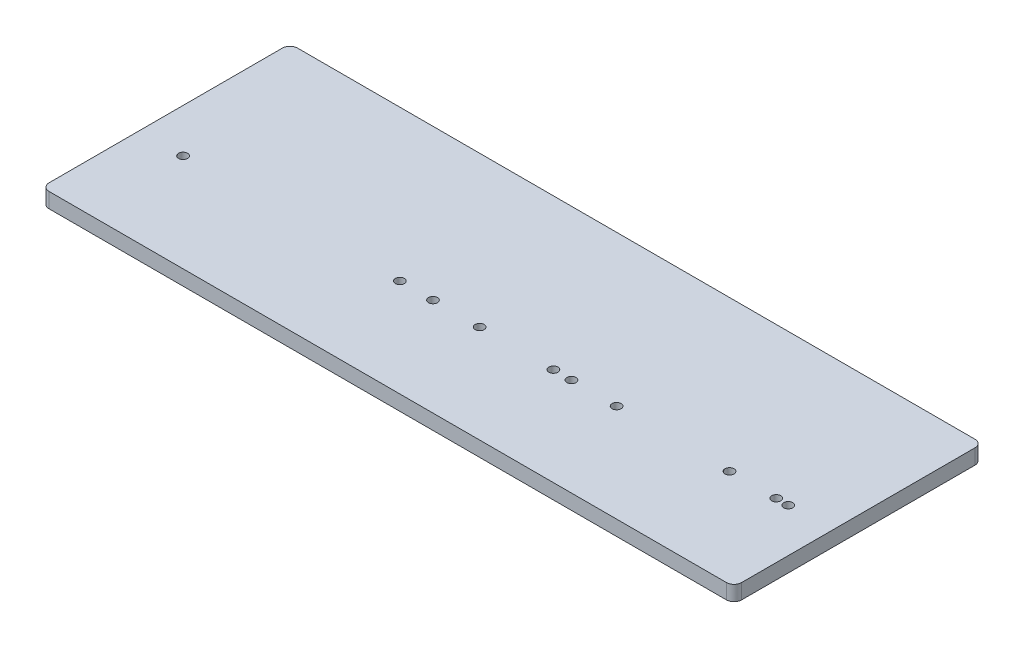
ISO-10303-21;
HEADER;
FILE_DESCRIPTION(('STEP AP214'),'2;1');
FILE_NAME('part.step','',(''),(''),'','','');
FILE_SCHEMA(('AUTOMOTIVE_DESIGN { 1 0 10303 214 1 1 1 1 }'));
ENDSEC;
DATA;
#1=APPLICATION_CONTEXT('core data for automotive mechanical design processes');
#2=APPLICATION_PROTOCOL_DEFINITION('international standard','automotive_design',2000,#1);
#3=PRODUCT_CONTEXT('',#1,'mechanical');
#4=PRODUCT('Part','Part','',(#3));
#5=PRODUCT_RELATED_PRODUCT_CATEGORY('part','',(#4));
#6=PRODUCT_DEFINITION_FORMATION('','',#4);
#7=PRODUCT_DEFINITION_CONTEXT('part definition',#1,'design');
#8=PRODUCT_DEFINITION('design','',#6,#7);
#9=PRODUCT_DEFINITION_SHAPE('','',#8);
#10=(LENGTH_UNIT() NAMED_UNIT(*) SI_UNIT(.MILLI.,.METRE.));
#11=(NAMED_UNIT(*) PLANE_ANGLE_UNIT() SI_UNIT($,.RADIAN.));
#12=(NAMED_UNIT(*) SI_UNIT($,.STERADIAN.) SOLID_ANGLE_UNIT());
#13=UNCERTAINTY_MEASURE_WITH_UNIT(LENGTH_MEASURE(1.E-05),#10,'distance_accuracy_value','');
#14=(GEOMETRIC_REPRESENTATION_CONTEXT(3) GLOBAL_UNCERTAINTY_ASSIGNED_CONTEXT((#13)) GLOBAL_UNIT_ASSIGNED_CONTEXT((#10,
#11,#12)) REPRESENTATION_CONTEXT('',''));
#15=CARTESIAN_POINT('',(0.,0.,0.));
#16=DIRECTION('',(0.,0.,1.));
#17=DIRECTION('',(1.,0.,0.));
#18=AXIS2_PLACEMENT_3D('',#15,#16,#17);
#19=CARTESIAN_POINT('',(-58.8284422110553,10.,-121.896582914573));
#20=DIRECTION('',(1.,0.,0.));
#21=DIRECTION('',(0.,0.,-1.));
#22=AXIS2_PLACEMENT_3D('',#19,#20,#21);
#23=PLANE('',#22);
#24=DIRECTION('',(0.,0.,1.));
#25=VECTOR('',#24,1.);
#26=CARTESIAN_POINT('',(-58.8284422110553,0.,-121.896582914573));
#27=LINE('',#26,#25);
#28=CARTESIAN_POINT('',(-58.8284422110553,0.,-116.896582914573));
#29=VERTEX_POINT('',#28);
#30=CARTESIAN_POINT('',(-58.8284422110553,0.,38.1034170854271));
#31=VERTEX_POINT('',#30);
#32=EDGE_CURVE('E155',#29,#31,#27,.T.);
#33=ORIENTED_EDGE('',*,*,#32,.T.);
#34=DIRECTION('',(0.,-1.,0.));
#35=VECTOR('',#34,1.);
#36=CARTESIAN_POINT('',(-58.8284422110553,10.,38.1034170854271));
#37=LINE('',#36,#35);
#38=CARTESIAN_POINT('',(-58.8284422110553,10.,38.1034170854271));
#39=VERTEX_POINT('',#38);
#40=EDGE_CURVE('E11',#31,#39,#37,.F.);
#41=ORIENTED_EDGE('',*,*,#40,.T.);
#42=DIRECTION('',(0.,0.,1.));
#43=VECTOR('',#42,1.);
#44=CARTESIAN_POINT('',(-58.8284422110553,10.,-121.896582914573));
#45=LINE('',#44,#43);
#46=CARTESIAN_POINT('',(-58.8284422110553,10.,-116.896582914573));
#47=VERTEX_POINT('',#46);
#48=EDGE_CURVE('E118',#47,#39,#45,.T.);
#49=ORIENTED_EDGE('',*,*,#48,.F.);
#50=DIRECTION('',(0.,-1.,0.));
#51=VECTOR('',#50,1.);
#52=CARTESIAN_POINT('',(-58.8284422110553,10.,-116.896582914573));
#53=LINE('',#52,#51);
#54=EDGE_CURVE('E34',#47,#29,#53,.T.);
#55=ORIENTED_EDGE('',*,*,#54,.T.);
#56=EDGE_LOOP('',(#33,#41,#49,#55));
#57=FACE_BOUND('',#56,.T.);
#58=ADVANCED_FACE('F27',(#57),#23,.F.);
#59=CARTESIAN_POINT('',(-58.8284422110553,10.,43.1034170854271));
#60=DIRECTION('',(0.,0.,-1.));
#61=DIRECTION('',(-1.,0.,0.));
#62=AXIS2_PLACEMENT_3D('',#59,#60,#61);
#63=PLANE('',#62);
#64=DIRECTION('',(1.,0.,0.));
#65=VECTOR('',#64,1.);
#66=CARTESIAN_POINT('',(-58.8284422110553,0.,43.1034170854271));
#67=LINE('',#66,#65);
#68=CARTESIAN_POINT('',(-53.8284422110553,0.,43.1034170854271));
#69=VERTEX_POINT('',#68);
#70=CARTESIAN_POINT('',(396.171557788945,0.,43.1034170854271));
#71=VERTEX_POINT('',#70);
#72=EDGE_CURVE('E123',#69,#71,#67,.T.);
#73=ORIENTED_EDGE('',*,*,#72,.T.);
#74=DIRECTION('',(0.,-1.,0.));
#75=VECTOR('',#74,1.);
#76=CARTESIAN_POINT('',(396.171557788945,10.,43.1034170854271));
#77=LINE('',#76,#75);
#78=CARTESIAN_POINT('',(396.171557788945,10.,43.1034170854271));
#79=VERTEX_POINT('',#78);
#80=EDGE_CURVE('E41',#71,#79,#77,.F.);
#81=ORIENTED_EDGE('',*,*,#80,.T.);
#82=DIRECTION('',(1.,0.,0.));
#83=VECTOR('',#82,1.);
#84=CARTESIAN_POINT('',(-58.8284422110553,10.,43.1034170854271));
#85=LINE('',#84,#83);
#86=CARTESIAN_POINT('',(-53.8284422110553,10.,43.1034170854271));
#87=VERTEX_POINT('',#86);
#88=EDGE_CURVE('E121',#87,#79,#85,.T.);
#89=ORIENTED_EDGE('',*,*,#88,.F.);
#90=DIRECTION('',(0.,-1.,0.));
#91=VECTOR('',#90,1.);
#92=CARTESIAN_POINT('',(-53.8284422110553,10.,43.1034170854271));
#93=LINE('',#92,#91);
#94=EDGE_CURVE('E147',#87,#69,#93,.T.);
#95=ORIENTED_EDGE('',*,*,#94,.T.);
#96=EDGE_LOOP('',(#73,#81,#89,#95));
#97=FACE_BOUND('',#96,.T.);
#98=ADVANCED_FACE('F253',(#97),#63,.F.);
#99=CARTESIAN_POINT('',(401.171557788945,10.,-121.896582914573));
#100=DIRECTION('',(-1.,0.,0.));
#101=DIRECTION('',(0.,0.,1.));
#102=AXIS2_PLACEMENT_3D('',#99,#100,#101);
#103=PLANE('',#102);
#104=DIRECTION('',(0.,0.,-1.));
#105=VECTOR('',#104,1.);
#106=CARTESIAN_POINT('',(401.171557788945,0.,-121.896582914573));
#107=LINE('',#106,#105);
#108=CARTESIAN_POINT('',(401.171557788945,0.,38.1034170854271));
#109=VERTEX_POINT('',#108);
#110=CARTESIAN_POINT('',(401.171557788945,0.,-116.896582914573));
#111=VERTEX_POINT('',#110);
#112=EDGE_CURVE('E119',#109,#111,#107,.T.);
#113=ORIENTED_EDGE('',*,*,#112,.T.);
#114=DIRECTION('',(0.,-1.,0.));
#115=VECTOR('',#114,1.);
#116=CARTESIAN_POINT('',(401.171557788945,10.,-116.896582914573));
#117=LINE('',#116,#115);
#118=CARTESIAN_POINT('',(401.171557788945,10.,-116.896582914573));
#119=VERTEX_POINT('',#118);
#120=EDGE_CURVE('E97',#111,#119,#117,.F.);
#121=ORIENTED_EDGE('',*,*,#120,.T.);
#122=DIRECTION('',(0.,0.,-1.));
#123=VECTOR('',#122,1.);
#124=CARTESIAN_POINT('',(401.171557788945,10.,-121.896582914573));
#125=LINE('',#124,#123);
#126=CARTESIAN_POINT('',(401.171557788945,10.,38.1034170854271));
#127=VERTEX_POINT('',#126);
#128=EDGE_CURVE('E128',#127,#119,#125,.T.);
#129=ORIENTED_EDGE('',*,*,#128,.F.);
#130=DIRECTION('',(0.,-1.,0.));
#131=VECTOR('',#130,1.);
#132=CARTESIAN_POINT('',(401.171557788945,10.,38.1034170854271));
#133=LINE('',#132,#131);
#134=EDGE_CURVE('E102',#127,#109,#133,.T.);
#135=ORIENTED_EDGE('',*,*,#134,.T.);
#136=EDGE_LOOP('',(#113,#121,#129,#135));
#137=FACE_BOUND('',#136,.T.);
#138=ADVANCED_FACE('F250',(#137),#103,.F.);
#139=CARTESIAN_POINT('',(-58.8284422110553,10.,-121.896582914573));
#140=DIRECTION('',(0.,0.,1.));
#141=DIRECTION('',(1.,0.,0.));
#142=AXIS2_PLACEMENT_3D('',#139,#140,#141);
#143=PLANE('',#142);
#144=DIRECTION('',(-1.,0.,0.));
#145=VECTOR('',#144,1.);
#146=CARTESIAN_POINT('',(-58.8284422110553,10.,-121.896582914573));
#147=LINE('',#146,#145);
#148=CARTESIAN_POINT('',(396.171557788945,10.,-121.896582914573));
#149=VERTEX_POINT('',#148);
#150=CARTESIAN_POINT('',(-53.8284422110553,10.,-121.896582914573));
#151=VERTEX_POINT('',#150);
#152=EDGE_CURVE('E112',#149,#151,#147,.T.);
#153=ORIENTED_EDGE('',*,*,#152,.F.);
#154=DIRECTION('',(0.,-1.,0.));
#155=VECTOR('',#154,1.);
#156=CARTESIAN_POINT('',(396.171557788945,10.,-121.896582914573));
#157=LINE('',#156,#155);
#158=CARTESIAN_POINT('',(396.171557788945,0.,-121.896582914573));
#159=VERTEX_POINT('',#158);
#160=EDGE_CURVE('E96',#149,#159,#157,.T.);
#161=ORIENTED_EDGE('',*,*,#160,.T.);
#162=DIRECTION('',(-1.,0.,0.));
#163=VECTOR('',#162,1.);
#164=CARTESIAN_POINT('',(-58.8284422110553,0.,-121.896582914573));
#165=LINE('',#164,#163);
#166=CARTESIAN_POINT('',(-53.8284422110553,0.,-121.896582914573));
#167=VERTEX_POINT('',#166);
#168=EDGE_CURVE('E109',#159,#167,#165,.T.);
#169=ORIENTED_EDGE('',*,*,#168,.T.);
#170=DIRECTION('',(0.,-1.,0.));
#171=VECTOR('',#170,1.);
#172=CARTESIAN_POINT('',(-53.8284422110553,10.,-121.896582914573));
#173=LINE('',#172,#171);
#174=EDGE_CURVE('E114',#167,#151,#173,.F.);
#175=ORIENTED_EDGE('',*,*,#174,.T.);
#176=EDGE_LOOP('',(#153,#161,#169,#175));
#177=FACE_BOUND('',#176,.T.);
#178=ADVANCED_FACE('F108',(#177),#143,.F.);
#179=CARTESIAN_POINT('',(-58.8284422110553,10.,43.1034170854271));
#180=DIRECTION('',(0.,1.,0.));
#181=DIRECTION('',(0.,0.,1.));
#182=AXIS2_PLACEMENT_3D('',#179,#180,#181);
#183=PLANE('',#182);
#184=CARTESIAN_POINT('',(372.171557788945,10.,-21.8965829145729));
#185=DIRECTION('',(0.,1.,0.));
#186=DIRECTION('',(0.,0.,1.));
#187=AXIS2_PLACEMENT_3D('',#184,#185,#186);
#188=CIRCLE('',#187,2.99999999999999);
#189=CARTESIAN_POINT('',(372.171557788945,10.,-18.8965829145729));
#190=VERTEX_POINT('',#189);
#191=EDGE_CURVE('E219',#190,#190,#188,.T.);
#192=ORIENTED_EDGE('',*,*,#191,.F.);
#193=EDGE_LOOP('',(#192));
#194=FACE_BOUND('',#193,.T.);
#195=CARTESIAN_POINT('',(364.171557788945,10.,-21.8965829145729));
#196=DIRECTION('',(0.,1.,0.));
#197=DIRECTION('',(0.,0.,1.));
#198=AXIS2_PLACEMENT_3D('',#195,#196,#197);
#199=CIRCLE('',#198,2.99999999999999);
#200=CARTESIAN_POINT('',(364.171557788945,10.,-18.8965829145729));
#201=VERTEX_POINT('',#200);
#202=EDGE_CURVE('E213',#201,#201,#199,.T.);
#203=ORIENTED_EDGE('',*,*,#202,.F.);
#204=EDGE_LOOP('',(#203));
#205=FACE_BOUND('',#204,.T.);
#206=CARTESIAN_POINT('',(333.171557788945,10.,-21.8965829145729));
#207=DIRECTION('',(0.,1.,0.));
#208=DIRECTION('',(0.,0.,1.));
#209=AXIS2_PLACEMENT_3D('',#206,#207,#208);
#210=CIRCLE('',#209,2.99999999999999);
#211=CARTESIAN_POINT('',(333.171557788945,10.,-18.8965829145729));
#212=VERTEX_POINT('',#211);
#213=EDGE_CURVE('E207',#212,#212,#210,.T.);
#214=ORIENTED_EDGE('',*,*,#213,.F.);
#215=EDGE_LOOP('',(#214));
#216=FACE_BOUND('',#215,.T.);
#217=CARTESIAN_POINT('',(258.171557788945,10.,-21.8965829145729));
#218=DIRECTION('',(0.,1.,0.));
#219=DIRECTION('',(0.,0.,1.));
#220=AXIS2_PLACEMENT_3D('',#217,#218,#219);
#221=CIRCLE('',#220,2.99999999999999);
#222=CARTESIAN_POINT('',(258.171557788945,10.,-18.8965829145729));
#223=VERTEX_POINT('',#222);
#224=EDGE_CURVE('E201',#223,#223,#221,.T.);
#225=ORIENTED_EDGE('',*,*,#224,.F.);
#226=EDGE_LOOP('',(#225));
#227=FACE_BOUND('',#226,.T.);
#228=CARTESIAN_POINT('',(228.171557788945,10.,-21.8965829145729));
#229=DIRECTION('',(0.,1.,0.));
#230=DIRECTION('',(0.,0.,1.));
#231=AXIS2_PLACEMENT_3D('',#228,#229,#230);
#232=CIRCLE('',#231,2.99999999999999);
#233=CARTESIAN_POINT('',(228.171557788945,10.,-18.8965829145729));
#234=VERTEX_POINT('',#233);
#235=EDGE_CURVE('E195',#234,#234,#232,.T.);
#236=ORIENTED_EDGE('',*,*,#235,.F.);
#237=EDGE_LOOP('',(#236));
#238=FACE_BOUND('',#237,.T.);
#239=CARTESIAN_POINT('',(216.171557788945,10.,-21.8965829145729));
#240=DIRECTION('',(0.,1.,0.));
#241=DIRECTION('',(0.,0.,1.));
#242=AXIS2_PLACEMENT_3D('',#239,#240,#241);
#243=CIRCLE('',#242,2.99999999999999);
#244=CARTESIAN_POINT('',(216.171557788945,10.,-18.8965829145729));
#245=VERTEX_POINT('',#244);
#246=EDGE_CURVE('E189',#245,#245,#243,.T.);
#247=ORIENTED_EDGE('',*,*,#246,.F.);
#248=EDGE_LOOP('',(#247));
#249=FACE_BOUND('',#248,.T.);
#250=CARTESIAN_POINT('',(167.171557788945,10.,-21.8965829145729));
#251=DIRECTION('',(0.,1.,0.));
#252=DIRECTION('',(0.,0.,1.));
#253=AXIS2_PLACEMENT_3D('',#250,#251,#252);
#254=CIRCLE('',#253,2.99999999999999);
#255=CARTESIAN_POINT('',(167.171557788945,10.,-18.8965829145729));
#256=VERTEX_POINT('',#255);
#257=EDGE_CURVE('E183',#256,#256,#254,.T.);
#258=ORIENTED_EDGE('',*,*,#257,.F.);
#259=EDGE_LOOP('',(#258));
#260=FACE_BOUND('',#259,.T.);
#261=CARTESIAN_POINT('',(114.171557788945,10.,-21.8965829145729));
#262=DIRECTION('',(0.,1.,0.));
#263=DIRECTION('',(0.,0.,1.));
#264=AXIS2_PLACEMENT_3D('',#261,#262,#263);
#265=CIRCLE('',#264,3.00000000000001);
#266=CARTESIAN_POINT('',(114.171557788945,10.,-18.8965829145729));
#267=VERTEX_POINT('',#266);
#268=EDGE_CURVE('E177',#267,#267,#265,.T.);
#269=ORIENTED_EDGE('',*,*,#268,.F.);
#270=EDGE_LOOP('',(#269));
#271=FACE_BOUND('',#270,.T.);
#272=CARTESIAN_POINT('',(136.171557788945,10.,-21.8965829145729));
#273=DIRECTION('',(0.,1.,0.));
#274=DIRECTION('',(0.,0.,1.));
#275=AXIS2_PLACEMENT_3D('',#272,#273,#274);
#276=CIRCLE('',#275,2.99999999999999);
#277=CARTESIAN_POINT('',(136.171557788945,10.,-18.8965829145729));
#278=VERTEX_POINT('',#277);
#279=EDGE_CURVE('E171',#278,#278,#276,.T.);
#280=ORIENTED_EDGE('',*,*,#279,.F.);
#281=EDGE_LOOP('',(#280));
#282=FACE_BOUND('',#281,.T.);
#283=CARTESIAN_POINT('',(-29.8284422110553,10.,-21.8965829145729));
#284=DIRECTION('',(0.,1.,0.));
#285=DIRECTION('',(0.,0.,1.));
#286=AXIS2_PLACEMENT_3D('',#283,#284,#285);
#287=CIRCLE('',#286,3.);
#288=CARTESIAN_POINT('',(-29.8284422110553,10.,-18.8965829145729));
#289=VERTEX_POINT('',#288);
#290=EDGE_CURVE('E163',#289,#289,#287,.T.);
#291=ORIENTED_EDGE('',*,*,#290,.F.);
#292=EDGE_LOOP('',(#291));
#293=FACE_BOUND('',#292,.T.);
#294=ORIENTED_EDGE('',*,*,#128,.T.);
#295=CARTESIAN_POINT('',(396.171557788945,10.,-116.896582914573));
#296=DIRECTION('',(0.,1.,0.));
#297=DIRECTION('',(0.,0.,1.));
#298=AXIS2_PLACEMENT_3D('',#295,#296,#297);
#299=CIRCLE('',#298,5.);
#300=EDGE_CURVE('E145',#119,#149,#299,.T.);
#301=ORIENTED_EDGE('',*,*,#300,.T.);
#302=ORIENTED_EDGE('',*,*,#152,.T.);
#303=CARTESIAN_POINT('',(-53.8284422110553,10.,-116.896582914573));
#304=DIRECTION('',(0.,1.,0.));
#305=DIRECTION('',(0.,0.,1.));
#306=AXIS2_PLACEMENT_3D('',#303,#304,#305);
#307=CIRCLE('',#306,5.);
#308=EDGE_CURVE('E140',#151,#47,#307,.T.);
#309=ORIENTED_EDGE('',*,*,#308,.T.);
#310=ORIENTED_EDGE('',*,*,#48,.T.);
#311=CARTESIAN_POINT('',(-53.8284422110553,10.,38.1034170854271));
#312=DIRECTION('',(0.,1.,0.));
#313=DIRECTION('',(0.,0.,1.));
#314=AXIS2_PLACEMENT_3D('',#311,#312,#313);
#315=CIRCLE('',#314,5.);
#316=EDGE_CURVE('E48',#39,#87,#315,.T.);
#317=ORIENTED_EDGE('',*,*,#316,.T.);
#318=ORIENTED_EDGE('',*,*,#88,.T.);
#319=CARTESIAN_POINT('',(396.171557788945,10.,38.1034170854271));
#320=DIRECTION('',(0.,1.,0.));
#321=DIRECTION('',(0.,0.,1.));
#322=AXIS2_PLACEMENT_3D('',#319,#320,#321);
#323=CIRCLE('',#322,5.);
#324=EDGE_CURVE('E143',#79,#127,#323,.T.);
#325=ORIENTED_EDGE('',*,*,#324,.T.);
#326=EDGE_LOOP('',(#294,#301,#302,#309,#310,#317,#318,#325));
#327=FACE_BOUND('',#326,.T.);
#328=ADVANCED_FACE('F225',(#194,#205,#216,#227,#238,#249,#260,#271,#282,#293,#327),#183,.T.);
#329=CARTESIAN_POINT('',(-58.8284422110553,0.,43.1034170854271));
#330=DIRECTION('',(0.,1.,0.));
#331=DIRECTION('',(0.,0.,1.));
#332=AXIS2_PLACEMENT_3D('',#329,#330,#331);
#333=PLANE('',#332);
#334=CARTESIAN_POINT('',(372.171557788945,0.,-21.8965829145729));
#335=DIRECTION('',(0.,1.,0.));
#336=DIRECTION('',(0.,0.,1.));
#337=AXIS2_PLACEMENT_3D('',#334,#335,#336);
#338=CIRCLE('',#337,2.99999999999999);
#339=CARTESIAN_POINT('',(372.171557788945,0.,-18.8965829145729));
#340=VERTEX_POINT('',#339);
#341=EDGE_CURVE('E216',#340,#340,#338,.T.);
#342=ORIENTED_EDGE('',*,*,#341,.T.);
#343=EDGE_LOOP('',(#342));
#344=FACE_BOUND('',#343,.T.);
#345=CARTESIAN_POINT('',(364.171557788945,0.,-21.8965829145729));
#346=DIRECTION('',(0.,1.,0.));
#347=DIRECTION('',(0.,0.,1.));
#348=AXIS2_PLACEMENT_3D('',#345,#346,#347);
#349=CIRCLE('',#348,2.99999999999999);
#350=CARTESIAN_POINT('',(364.171557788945,0.,-18.8965829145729));
#351=VERTEX_POINT('',#350);
#352=EDGE_CURVE('E210',#351,#351,#349,.T.);
#353=ORIENTED_EDGE('',*,*,#352,.T.);
#354=EDGE_LOOP('',(#353));
#355=FACE_BOUND('',#354,.T.);
#356=CARTESIAN_POINT('',(333.171557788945,0.,-21.8965829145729));
#357=DIRECTION('',(0.,1.,0.));
#358=DIRECTION('',(0.,0.,1.));
#359=AXIS2_PLACEMENT_3D('',#356,#357,#358);
#360=CIRCLE('',#359,2.99999999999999);
#361=CARTESIAN_POINT('',(333.171557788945,0.,-18.8965829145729));
#362=VERTEX_POINT('',#361);
#363=EDGE_CURVE('E204',#362,#362,#360,.T.);
#364=ORIENTED_EDGE('',*,*,#363,.T.);
#365=EDGE_LOOP('',(#364));
#366=FACE_BOUND('',#365,.T.);
#367=CARTESIAN_POINT('',(258.171557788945,0.,-21.8965829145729));
#368=DIRECTION('',(0.,1.,0.));
#369=DIRECTION('',(0.,0.,1.));
#370=AXIS2_PLACEMENT_3D('',#367,#368,#369);
#371=CIRCLE('',#370,2.99999999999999);
#372=CARTESIAN_POINT('',(258.171557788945,0.,-18.8965829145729));
#373=VERTEX_POINT('',#372);
#374=EDGE_CURVE('E198',#373,#373,#371,.T.);
#375=ORIENTED_EDGE('',*,*,#374,.T.);
#376=EDGE_LOOP('',(#375));
#377=FACE_BOUND('',#376,.T.);
#378=CARTESIAN_POINT('',(228.171557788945,0.,-21.8965829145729));
#379=DIRECTION('',(0.,1.,0.));
#380=DIRECTION('',(0.,0.,1.));
#381=AXIS2_PLACEMENT_3D('',#378,#379,#380);
#382=CIRCLE('',#381,2.99999999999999);
#383=CARTESIAN_POINT('',(228.171557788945,0.,-18.8965829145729));
#384=VERTEX_POINT('',#383);
#385=EDGE_CURVE('E192',#384,#384,#382,.T.);
#386=ORIENTED_EDGE('',*,*,#385,.T.);
#387=EDGE_LOOP('',(#386));
#388=FACE_BOUND('',#387,.T.);
#389=CARTESIAN_POINT('',(216.171557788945,0.,-21.8965829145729));
#390=DIRECTION('',(0.,1.,0.));
#391=DIRECTION('',(0.,0.,1.));
#392=AXIS2_PLACEMENT_3D('',#389,#390,#391);
#393=CIRCLE('',#392,2.99999999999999);
#394=CARTESIAN_POINT('',(216.171557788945,0.,-18.8965829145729));
#395=VERTEX_POINT('',#394);
#396=EDGE_CURVE('E186',#395,#395,#393,.T.);
#397=ORIENTED_EDGE('',*,*,#396,.T.);
#398=EDGE_LOOP('',(#397));
#399=FACE_BOUND('',#398,.T.);
#400=CARTESIAN_POINT('',(167.171557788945,0.,-21.8965829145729));
#401=DIRECTION('',(0.,1.,0.));
#402=DIRECTION('',(0.,0.,1.));
#403=AXIS2_PLACEMENT_3D('',#400,#401,#402);
#404=CIRCLE('',#403,2.99999999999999);
#405=CARTESIAN_POINT('',(167.171557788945,0.,-18.8965829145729));
#406=VERTEX_POINT('',#405);
#407=EDGE_CURVE('E180',#406,#406,#404,.T.);
#408=ORIENTED_EDGE('',*,*,#407,.T.);
#409=EDGE_LOOP('',(#408));
#410=FACE_BOUND('',#409,.T.);
#411=CARTESIAN_POINT('',(114.171557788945,0.,-21.8965829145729));
#412=DIRECTION('',(0.,1.,0.));
#413=DIRECTION('',(0.,0.,1.));
#414=AXIS2_PLACEMENT_3D('',#411,#412,#413);
#415=CIRCLE('',#414,3.00000000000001);
#416=CARTESIAN_POINT('',(114.171557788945,0.,-18.8965829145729));
#417=VERTEX_POINT('',#416);
#418=EDGE_CURVE('E174',#417,#417,#415,.T.);
#419=ORIENTED_EDGE('',*,*,#418,.T.);
#420=EDGE_LOOP('',(#419));
#421=FACE_BOUND('',#420,.T.);
#422=CARTESIAN_POINT('',(136.171557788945,0.,-21.8965829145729));
#423=DIRECTION('',(0.,1.,0.));
#424=DIRECTION('',(0.,0.,1.));
#425=AXIS2_PLACEMENT_3D('',#422,#423,#424);
#426=CIRCLE('',#425,2.99999999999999);
#427=CARTESIAN_POINT('',(136.171557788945,0.,-18.8965829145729));
#428=VERTEX_POINT('',#427);
#429=EDGE_CURVE('E168',#428,#428,#426,.T.);
#430=ORIENTED_EDGE('',*,*,#429,.T.);
#431=EDGE_LOOP('',(#430));
#432=FACE_BOUND('',#431,.T.);
#433=CARTESIAN_POINT('',(-29.8284422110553,0.,-21.8965829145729));
#434=DIRECTION('',(0.,1.,0.));
#435=DIRECTION('',(0.,0.,1.));
#436=AXIS2_PLACEMENT_3D('',#433,#434,#435);
#437=CIRCLE('',#436,3.);
#438=CARTESIAN_POINT('',(-29.8284422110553,0.,-18.8965829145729));
#439=VERTEX_POINT('',#438);
#440=EDGE_CURVE('E160',#439,#439,#437,.T.);
#441=ORIENTED_EDGE('',*,*,#440,.T.);
#442=EDGE_LOOP('',(#441));
#443=FACE_BOUND('',#442,.T.);
#444=ORIENTED_EDGE('',*,*,#168,.F.);
#445=CARTESIAN_POINT('',(396.171557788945,0.,-116.896582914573));
#446=DIRECTION('',(0.,1.,0.));
#447=DIRECTION('',(0.,0.,1.));
#448=AXIS2_PLACEMENT_3D('',#445,#446,#447);
#449=CIRCLE('',#448,5.);
#450=EDGE_CURVE('E92',#159,#111,#449,.F.);
#451=ORIENTED_EDGE('',*,*,#450,.T.);
#452=ORIENTED_EDGE('',*,*,#112,.F.);
#453=CARTESIAN_POINT('',(396.171557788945,0.,38.1034170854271));
#454=DIRECTION('',(0.,1.,0.));
#455=DIRECTION('',(0.,0.,1.));
#456=AXIS2_PLACEMENT_3D('',#453,#454,#455);
#457=CIRCLE('',#456,5.);
#458=EDGE_CURVE('E103',#109,#71,#457,.F.);
#459=ORIENTED_EDGE('',*,*,#458,.T.);
#460=ORIENTED_EDGE('',*,*,#72,.F.);
#461=CARTESIAN_POINT('',(-53.8284422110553,0.,38.1034170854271));
#462=DIRECTION('',(0.,1.,0.));
#463=DIRECTION('',(0.,0.,1.));
#464=AXIS2_PLACEMENT_3D('',#461,#462,#463);
#465=CIRCLE('',#464,5.);
#466=EDGE_CURVE('E134',#69,#31,#465,.F.);
#467=ORIENTED_EDGE('',*,*,#466,.T.);
#468=ORIENTED_EDGE('',*,*,#32,.F.);
#469=CARTESIAN_POINT('',(-53.8284422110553,0.,-116.896582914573));
#470=DIRECTION('',(0.,1.,0.));
#471=DIRECTION('',(0.,0.,1.));
#472=AXIS2_PLACEMENT_3D('',#469,#470,#471);
#473=CIRCLE('',#472,5.);
#474=EDGE_CURVE('E113',#29,#167,#473,.F.);
#475=ORIENTED_EDGE('',*,*,#474,.T.);
#476=EDGE_LOOP('',(#444,#451,#452,#459,#460,#467,#468,#475));
#477=FACE_BOUND('',#476,.T.);
#478=ADVANCED_FACE('F116',(#344,#355,#366,#377,#388,#399,#410,#421,#432,#443,#477),#333,.F.);
#479=CARTESIAN_POINT('',(-29.8284422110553,0.,-21.8965829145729));
#480=DIRECTION('',(0.,1.,0.));
#481=DIRECTION('',(0.,0.,1.));
#482=AXIS2_PLACEMENT_3D('',#479,#480,#481);
#483=CYLINDRICAL_SURFACE('',#482,3.);
#484=ORIENTED_EDGE('',*,*,#440,.F.);
#485=EDGE_LOOP('',(#484));
#486=FACE_BOUND('',#485,.T.);
#487=ORIENTED_EDGE('',*,*,#290,.T.);
#488=EDGE_LOOP('',(#487));
#489=FACE_BOUND('',#488,.T.);
#490=ADVANCED_FACE('F278',(#486,#489),#483,.F.);
#491=CARTESIAN_POINT('',(136.171557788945,0.,-21.8965829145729));
#492=DIRECTION('',(0.,1.,0.));
#493=DIRECTION('',(0.,0.,1.));
#494=AXIS2_PLACEMENT_3D('',#491,#492,#493);
#495=CYLINDRICAL_SURFACE('',#494,2.99999999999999);
#496=ORIENTED_EDGE('',*,*,#429,.F.);
#497=EDGE_LOOP('',(#496));
#498=FACE_BOUND('',#497,.T.);
#499=ORIENTED_EDGE('',*,*,#279,.T.);
#500=EDGE_LOOP('',(#499));
#501=FACE_BOUND('',#500,.T.);
#502=ADVANCED_FACE('F282',(#498,#501),#495,.F.);
#503=CARTESIAN_POINT('',(114.171557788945,0.,-21.8965829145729));
#504=DIRECTION('',(0.,1.,0.));
#505=DIRECTION('',(0.,0.,1.));
#506=AXIS2_PLACEMENT_3D('',#503,#504,#505);
#507=CYLINDRICAL_SURFACE('',#506,3.00000000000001);
#508=ORIENTED_EDGE('',*,*,#418,.F.);
#509=EDGE_LOOP('',(#508));
#510=FACE_BOUND('',#509,.T.);
#511=ORIENTED_EDGE('',*,*,#268,.T.);
#512=EDGE_LOOP('',(#511));
#513=FACE_BOUND('',#512,.T.);
#514=ADVANCED_FACE('F286',(#510,#513),#507,.F.);
#515=CARTESIAN_POINT('',(167.171557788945,0.,-21.8965829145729));
#516=DIRECTION('',(0.,1.,0.));
#517=DIRECTION('',(0.,0.,1.));
#518=AXIS2_PLACEMENT_3D('',#515,#516,#517);
#519=CYLINDRICAL_SURFACE('',#518,2.99999999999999);
#520=ORIENTED_EDGE('',*,*,#407,.F.);
#521=EDGE_LOOP('',(#520));
#522=FACE_BOUND('',#521,.T.);
#523=ORIENTED_EDGE('',*,*,#257,.T.);
#524=EDGE_LOOP('',(#523));
#525=FACE_BOUND('',#524,.T.);
#526=ADVANCED_FACE('F290',(#522,#525),#519,.F.);
#527=CARTESIAN_POINT('',(216.171557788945,0.,-21.8965829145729));
#528=DIRECTION('',(0.,1.,0.));
#529=DIRECTION('',(0.,0.,1.));
#530=AXIS2_PLACEMENT_3D('',#527,#528,#529);
#531=CYLINDRICAL_SURFACE('',#530,2.99999999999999);
#532=ORIENTED_EDGE('',*,*,#396,.F.);
#533=EDGE_LOOP('',(#532));
#534=FACE_BOUND('',#533,.T.);
#535=ORIENTED_EDGE('',*,*,#246,.T.);
#536=EDGE_LOOP('',(#535));
#537=FACE_BOUND('',#536,.T.);
#538=ADVANCED_FACE('F294',(#534,#537),#531,.F.);
#539=CARTESIAN_POINT('',(228.171557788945,0.,-21.8965829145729));
#540=DIRECTION('',(0.,1.,0.));
#541=DIRECTION('',(0.,0.,1.));
#542=AXIS2_PLACEMENT_3D('',#539,#540,#541);
#543=CYLINDRICAL_SURFACE('',#542,2.99999999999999);
#544=ORIENTED_EDGE('',*,*,#385,.F.);
#545=EDGE_LOOP('',(#544));
#546=FACE_BOUND('',#545,.T.);
#547=ORIENTED_EDGE('',*,*,#235,.T.);
#548=EDGE_LOOP('',(#547));
#549=FACE_BOUND('',#548,.T.);
#550=ADVANCED_FACE('F298',(#546,#549),#543,.F.);
#551=CARTESIAN_POINT('',(258.171557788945,0.,-21.8965829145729));
#552=DIRECTION('',(0.,1.,0.));
#553=DIRECTION('',(0.,0.,1.));
#554=AXIS2_PLACEMENT_3D('',#551,#552,#553);
#555=CYLINDRICAL_SURFACE('',#554,2.99999999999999);
#556=ORIENTED_EDGE('',*,*,#374,.F.);
#557=EDGE_LOOP('',(#556));
#558=FACE_BOUND('',#557,.T.);
#559=ORIENTED_EDGE('',*,*,#224,.T.);
#560=EDGE_LOOP('',(#559));
#561=FACE_BOUND('',#560,.T.);
#562=ADVANCED_FACE('F302',(#558,#561),#555,.F.);
#563=CARTESIAN_POINT('',(333.171557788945,0.,-21.8965829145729));
#564=DIRECTION('',(0.,1.,0.));
#565=DIRECTION('',(0.,0.,1.));
#566=AXIS2_PLACEMENT_3D('',#563,#564,#565);
#567=CYLINDRICAL_SURFACE('',#566,2.99999999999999);
#568=ORIENTED_EDGE('',*,*,#363,.F.);
#569=EDGE_LOOP('',(#568));
#570=FACE_BOUND('',#569,.T.);
#571=ORIENTED_EDGE('',*,*,#213,.T.);
#572=EDGE_LOOP('',(#571));
#573=FACE_BOUND('',#572,.T.);
#574=ADVANCED_FACE('F306',(#570,#573),#567,.F.);
#575=CARTESIAN_POINT('',(364.171557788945,0.,-21.8965829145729));
#576=DIRECTION('',(0.,1.,0.));
#577=DIRECTION('',(0.,0.,1.));
#578=AXIS2_PLACEMENT_3D('',#575,#576,#577);
#579=CYLINDRICAL_SURFACE('',#578,2.99999999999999);
#580=ORIENTED_EDGE('',*,*,#352,.F.);
#581=EDGE_LOOP('',(#580));
#582=FACE_BOUND('',#581,.T.);
#583=ORIENTED_EDGE('',*,*,#202,.T.);
#584=EDGE_LOOP('',(#583));
#585=FACE_BOUND('',#584,.T.);
#586=ADVANCED_FACE('F310',(#582,#585),#579,.F.);
#587=CARTESIAN_POINT('',(372.171557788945,0.,-21.8965829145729));
#588=DIRECTION('',(0.,1.,0.));
#589=DIRECTION('',(0.,0.,1.));
#590=AXIS2_PLACEMENT_3D('',#587,#588,#589);
#591=CYLINDRICAL_SURFACE('',#590,2.99999999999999);
#592=ORIENTED_EDGE('',*,*,#341,.F.);
#593=EDGE_LOOP('',(#592));
#594=FACE_BOUND('',#593,.T.);
#595=ORIENTED_EDGE('',*,*,#191,.T.);
#596=EDGE_LOOP('',(#595));
#597=FACE_BOUND('',#596,.T.);
#598=ADVANCED_FACE('F223',(#594,#597),#591,.F.);
#599=CARTESIAN_POINT('',(396.171557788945,10.,-116.896582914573));
#600=DIRECTION('',(0.,-1.,0.));
#601=DIRECTION('',(0.,0.,-1.));
#602=AXIS2_PLACEMENT_3D('',#599,#600,#601);
#603=CYLINDRICAL_SURFACE('',#602,5.);
#604=ORIENTED_EDGE('',*,*,#300,.F.);
#605=ORIENTED_EDGE('',*,*,#120,.F.);
#606=ORIENTED_EDGE('',*,*,#450,.F.);
#607=ORIENTED_EDGE('',*,*,#160,.F.);
#608=EDGE_LOOP('',(#604,#605,#606,#607));
#609=FACE_BOUND('',#608,.T.);
#610=ADVANCED_FACE('F95',(#609),#603,.T.);
#611=CARTESIAN_POINT('',(396.171557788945,10.,38.1034170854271));
#612=DIRECTION('',(0.,-1.,0.));
#613=DIRECTION('',(0.,0.,-1.));
#614=AXIS2_PLACEMENT_3D('',#611,#612,#613);
#615=CYLINDRICAL_SURFACE('',#614,5.);
#616=ORIENTED_EDGE('',*,*,#324,.F.);
#617=ORIENTED_EDGE('',*,*,#80,.F.);
#618=ORIENTED_EDGE('',*,*,#458,.F.);
#619=ORIENTED_EDGE('',*,*,#134,.F.);
#620=EDGE_LOOP('',(#616,#617,#618,#619));
#621=FACE_BOUND('',#620,.T.);
#622=ADVANCED_FACE('F252',(#621),#615,.T.);
#623=CARTESIAN_POINT('',(-53.8284422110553,10.,38.1034170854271));
#624=DIRECTION('',(0.,-1.,0.));
#625=DIRECTION('',(0.,0.,-1.));
#626=AXIS2_PLACEMENT_3D('',#623,#624,#625);
#627=CYLINDRICAL_SURFACE('',#626,5.);
#628=ORIENTED_EDGE('',*,*,#316,.F.);
#629=ORIENTED_EDGE('',*,*,#40,.F.);
#630=ORIENTED_EDGE('',*,*,#466,.F.);
#631=ORIENTED_EDGE('',*,*,#94,.F.);
#632=EDGE_LOOP('',(#628,#629,#630,#631));
#633=FACE_BOUND('',#632,.T.);
#634=ADVANCED_FACE('F256',(#633),#627,.T.);
#635=CARTESIAN_POINT('',(-53.8284422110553,10.,-116.896582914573));
#636=DIRECTION('',(0.,-1.,0.));
#637=DIRECTION('',(0.,0.,-1.));
#638=AXIS2_PLACEMENT_3D('',#635,#636,#637);
#639=CYLINDRICAL_SURFACE('',#638,5.);
#640=ORIENTED_EDGE('',*,*,#308,.F.);
#641=ORIENTED_EDGE('',*,*,#174,.F.);
#642=ORIENTED_EDGE('',*,*,#474,.F.);
#643=ORIENTED_EDGE('',*,*,#54,.F.);
#644=EDGE_LOOP('',(#640,#641,#642,#643));
#645=FACE_BOUND('',#644,.T.);
#646=ADVANCED_FACE('F257',(#645),#639,.T.);
#647=CLOSED_SHELL('',(#58,#98,#138,#178,#328,#478,#490,#502,#514,#526,#538,#550,#562,#574,#586,
#598,#610,#622,#634,#646));
#648=MANIFOLD_SOLID_BREP('B2',#647);
#649=ADVANCED_BREP_SHAPE_REPRESENTATION('',(#18,#648),#14);
#650=SHAPE_DEFINITION_REPRESENTATION(#9,#649);
ENDSEC;
END-ISO-10303-21;
